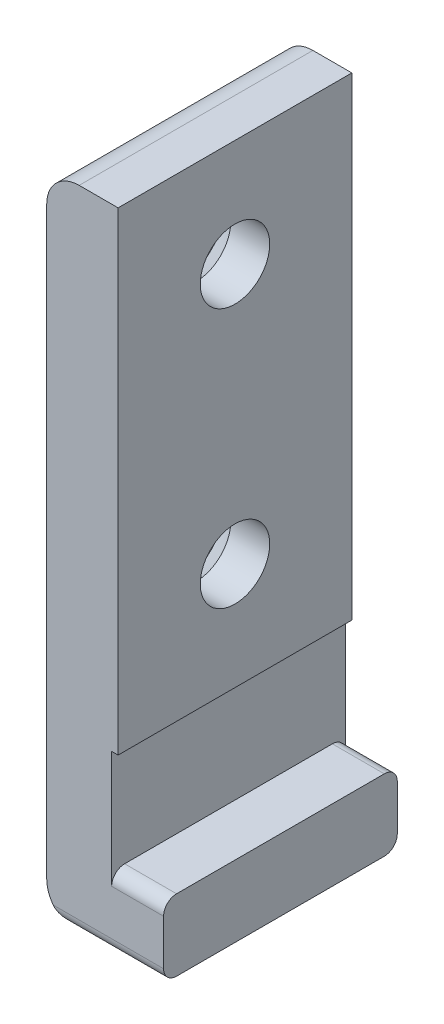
ISO-10303-21;
HEADER;
FILE_DESCRIPTION(('STEP AP214'),'2;1');
FILE_NAME('part.step','',(''),(''),'','','');
FILE_SCHEMA(('AUTOMOTIVE_DESIGN { 1 0 10303 214 1 1 1 1 }'));
ENDSEC;
DATA;
#1=APPLICATION_CONTEXT('core data for automotive mechanical design processes');
#2=APPLICATION_PROTOCOL_DEFINITION('international standard','automotive_design',2000,#1);
#3=PRODUCT_CONTEXT('',#1,'mechanical');
#4=PRODUCT('Part','Part','',(#3));
#5=PRODUCT_RELATED_PRODUCT_CATEGORY('part','',(#4));
#6=PRODUCT_DEFINITION_FORMATION('','',#4);
#7=PRODUCT_DEFINITION_CONTEXT('part definition',#1,'design');
#8=PRODUCT_DEFINITION('design','',#6,#7);
#9=PRODUCT_DEFINITION_SHAPE('','',#8);
#10=(LENGTH_UNIT() NAMED_UNIT(*) SI_UNIT(.MILLI.,.METRE.));
#11=(NAMED_UNIT(*) PLANE_ANGLE_UNIT() SI_UNIT($,.RADIAN.));
#12=(NAMED_UNIT(*) SI_UNIT($,.STERADIAN.) SOLID_ANGLE_UNIT());
#13=UNCERTAINTY_MEASURE_WITH_UNIT(LENGTH_MEASURE(1.E-05),#10,'distance_accuracy_value','');
#14=(GEOMETRIC_REPRESENTATION_CONTEXT(3) GLOBAL_UNCERTAINTY_ASSIGNED_CONTEXT((#13)) GLOBAL_UNIT_ASSIGNED_CONTEXT((#10,
#11,#12)) REPRESENTATION_CONTEXT('',''));
#15=CARTESIAN_POINT('',(0.,0.,0.));
#16=DIRECTION('',(0.,0.,1.));
#17=DIRECTION('',(1.,0.,0.));
#18=AXIS2_PLACEMENT_3D('',#15,#16,#17);
#19=CARTESIAN_POINT('',(0.,0.,9.));
#20=DIRECTION('',(0.,-1.,0.));
#21=DIRECTION('',(0.,0.,-1.));
#22=AXIS2_PLACEMENT_3D('',#19,#20,#21);
#23=PLANE('',#22);
#24=DIRECTION('',(0.,0.,-1.));
#25=VECTOR('',#24,1.);
#26=CARTESIAN_POINT('',(4.,0.,9.));
#27=LINE('',#26,#25);
#28=CARTESIAN_POINT('',(4.,0.,8.));
#29=VERTEX_POINT('',#28);
#30=CARTESIAN_POINT('',(4.,0.,-8.));
#31=VERTEX_POINT('',#30);
#32=EDGE_CURVE('E183',#29,#31,#27,.T.);
#33=ORIENTED_EDGE('',*,*,#32,.T.);
#34=DIRECTION('',(-1.,0.,0.));
#35=VECTOR('',#34,1.);
#36=CARTESIAN_POINT('',(0.,0.,-8.));
#37=LINE('',#36,#35);
#38=CARTESIAN_POINT('',(0.,0.,-8.));
#39=VERTEX_POINT('',#38);
#40=EDGE_CURVE('E330',#31,#39,#37,.T.);
#41=ORIENTED_EDGE('',*,*,#40,.T.);
#42=DIRECTION('',(0.,0.,-1.));
#43=VECTOR('',#42,1.);
#44=CARTESIAN_POINT('',(0.,0.,9.));
#45=LINE('',#44,#43);
#46=CARTESIAN_POINT('',(0.,0.,8.));
#47=VERTEX_POINT('',#46);
#48=EDGE_CURVE('E196',#47,#39,#45,.T.);
#49=ORIENTED_EDGE('',*,*,#48,.F.);
#50=DIRECTION('',(-1.,0.,0.));
#51=VECTOR('',#50,1.);
#52=CARTESIAN_POINT('',(0.,0.,8.));
#53=LINE('',#52,#51);
#54=EDGE_CURVE('E326',#47,#29,#53,.F.);
#55=ORIENTED_EDGE('',*,*,#54,.T.);
#56=EDGE_LOOP('',(#33,#41,#49,#55));
#57=FACE_BOUND('',#56,.T.);
#58=ADVANCED_FACE('F36',(#57),#23,.F.);
#59=CARTESIAN_POINT('',(0.,0.,9.));
#60=DIRECTION('',(-1.,0.,0.));
#61=DIRECTION('',(0.,0.,1.));
#62=AXIS2_PLACEMENT_3D('',#59,#60,#61);
#63=PLANE('',#62);
#64=DIRECTION('',(0.,1.,0.));
#65=VECTOR('',#64,1.);
#66=CARTESIAN_POINT('',(0.,0.,-9.));
#67=LINE('',#66,#65);
#68=CARTESIAN_POINT('',(0.,-1.,-9.));
#69=VERTEX_POINT('',#68);
#70=CARTESIAN_POINT('',(0.,8.,-9.));
#71=VERTEX_POINT('',#70);
#72=EDGE_CURVE('E169',#69,#71,#67,.T.);
#73=ORIENTED_EDGE('',*,*,#72,.T.);
#74=DIRECTION('',(0.,0.,1.));
#75=VECTOR('',#74,1.);
#76=CARTESIAN_POINT('',(0.,8.,-45.503424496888));
#77=LINE('',#76,#75);
#78=CARTESIAN_POINT('',(0.,8.,9.));
#79=VERTEX_POINT('',#78);
#80=EDGE_CURVE('E161',#71,#79,#77,.T.);
#81=ORIENTED_EDGE('',*,*,#80,.T.);
#82=DIRECTION('',(0.,1.,0.));
#83=VECTOR('',#82,1.);
#84=CARTESIAN_POINT('',(0.,0.,9.));
#85=LINE('',#84,#83);
#86=CARTESIAN_POINT('',(0.,-1.,9.));
#87=VERTEX_POINT('',#86);
#88=EDGE_CURVE('E170',#87,#79,#85,.T.);
#89=ORIENTED_EDGE('',*,*,#88,.F.);
#90=CARTESIAN_POINT('',(0.,-1.,8.));
#91=DIRECTION('',(-1.,0.,0.));
#92=DIRECTION('',(0.,0.,1.));
#93=AXIS2_PLACEMENT_3D('',#90,#91,#92);
#94=CIRCLE('',#93,1.);
#95=EDGE_CURVE('E11',#87,#47,#94,.T.);
#96=ORIENTED_EDGE('',*,*,#95,.T.);
#97=ORIENTED_EDGE('',*,*,#48,.T.);
#98=CARTESIAN_POINT('',(0.,-1.,-8.));
#99=DIRECTION('',(-1.,0.,0.));
#100=DIRECTION('',(0.,0.,1.));
#101=AXIS2_PLACEMENT_3D('',#98,#99,#100);
#102=CIRCLE('',#101,1.);
#103=EDGE_CURVE('E44',#39,#69,#102,.T.);
#104=ORIENTED_EDGE('',*,*,#103,.T.);
#105=EDGE_LOOP('',(#73,#81,#89,#96,#97,#104));
#106=FACE_BOUND('',#105,.T.);
#107=ADVANCED_FACE('F280',(#106),#63,.F.);
#108=CARTESIAN_POINT('',(-5.,44.5,9.));
#109=DIRECTION('',(0.,-1.,0.));
#110=DIRECTION('',(0.,0.,-1.));
#111=AXIS2_PLACEMENT_3D('',#108,#109,#110);
#112=PLANE('',#111);
#113=DIRECTION('',(-1.,0.,0.));
#114=VECTOR('',#113,1.);
#115=CARTESIAN_POINT('',(-5.,44.5,-9.));
#116=LINE('',#115,#114);
#117=CARTESIAN_POINT('',(0.5,44.5,-9.));
#118=VERTEX_POINT('',#117);
#119=CARTESIAN_POINT('',(-2.5,44.5,-9.));
#120=VERTEX_POINT('',#119);
#121=EDGE_CURVE('E145',#118,#120,#116,.T.);
#122=ORIENTED_EDGE('',*,*,#121,.T.);
#123=DIRECTION('',(0.,0.,-1.));
#124=VECTOR('',#123,1.);
#125=CARTESIAN_POINT('',(-2.5,44.5,9.));
#126=LINE('',#125,#124);
#127=CARTESIAN_POINT('',(-2.5,44.5,9.));
#128=VERTEX_POINT('',#127);
#129=EDGE_CURVE('E207',#120,#128,#126,.F.);
#130=ORIENTED_EDGE('',*,*,#129,.T.);
#131=DIRECTION('',(-1.,0.,0.));
#132=VECTOR('',#131,1.);
#133=CARTESIAN_POINT('',(-5.,44.5,9.));
#134=LINE('',#133,#132);
#135=CARTESIAN_POINT('',(0.5,44.5,9.));
#136=VERTEX_POINT('',#135);
#137=EDGE_CURVE('E173',#136,#128,#134,.T.);
#138=ORIENTED_EDGE('',*,*,#137,.F.);
#139=DIRECTION('',(0.,0.,1.));
#140=VECTOR('',#139,1.);
#141=CARTESIAN_POINT('',(0.5,44.5,-45.503424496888));
#142=LINE('',#141,#140);
#143=EDGE_CURVE('E149',#118,#136,#142,.T.);
#144=ORIENTED_EDGE('',*,*,#143,.F.);
#145=EDGE_LOOP('',(#122,#130,#138,#144));
#146=FACE_BOUND('',#145,.T.);
#147=ADVANCED_FACE('F286',(#146),#112,.F.);
#148=CARTESIAN_POINT('',(-5.,-5.5,9.));
#149=DIRECTION('',(1.,0.,0.));
#150=DIRECTION('',(0.,1.,0.));
#151=AXIS2_PLACEMENT_3D('',#148,#149,#150);
#152=PLANE('',#151);
#153=CARTESIAN_POINT('',(-5.,16.25,0.));
#154=DIRECTION('',(1.,0.,0.));
#155=DIRECTION('',(0.,1.,0.));
#156=AXIS2_PLACEMENT_3D('',#153,#154,#155);
#157=CIRCLE('',#156,5.17499999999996);
#158=CARTESIAN_POINT('',(-5.,21.425,0.));
#159=VERTEX_POINT('',#158);
#160=EDGE_CURVE('E220',#159,#159,#157,.T.);
#161=ORIENTED_EDGE('',*,*,#160,.T.);
#162=EDGE_LOOP('',(#161));
#163=FACE_BOUND('',#162,.T.);
#164=CARTESIAN_POINT('',(-5.,36.25,0.));
#165=DIRECTION('',(1.,0.,0.));
#166=DIRECTION('',(0.,1.,0.));
#167=AXIS2_PLACEMENT_3D('',#164,#165,#166);
#168=CIRCLE('',#167,5.17499999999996);
#169=CARTESIAN_POINT('',(-5.,41.425,0.));
#170=VERTEX_POINT('',#169);
#171=EDGE_CURVE('E217',#170,#170,#168,.T.);
#172=ORIENTED_EDGE('',*,*,#171,.T.);
#173=EDGE_LOOP('',(#172));
#174=FACE_BOUND('',#173,.T.);
#175=DIRECTION('',(0.,-1.,0.));
#176=VECTOR('',#175,1.);
#177=CARTESIAN_POINT('',(-5.,-5.5,9.));
#178=LINE('',#177,#176);
#179=CARTESIAN_POINT('',(-5.,42.,9.));
#180=VERTEX_POINT('',#179);
#181=CARTESIAN_POINT('',(-5.,-3.,9.));
#182=VERTEX_POINT('',#181);
#183=EDGE_CURVE('E177',#180,#182,#178,.T.);
#184=ORIENTED_EDGE('',*,*,#183,.F.);
#185=DIRECTION('',(0.,0.,-1.));
#186=VECTOR('',#185,1.);
#187=CARTESIAN_POINT('',(-5.,42.,9.));
#188=LINE('',#187,#186);
#189=CARTESIAN_POINT('',(-5.,42.,-9.));
#190=VERTEX_POINT('',#189);
#191=EDGE_CURVE('E200',#180,#190,#188,.T.);
#192=ORIENTED_EDGE('',*,*,#191,.T.);
#193=DIRECTION('',(0.,-1.,0.));
#194=VECTOR('',#193,1.);
#195=CARTESIAN_POINT('',(-5.,-5.5,-9.));
#196=LINE('',#195,#194);
#197=CARTESIAN_POINT('',(-5.,-3.,-9.));
#198=VERTEX_POINT('',#197);
#199=EDGE_CURVE('E186',#190,#198,#196,.T.);
#200=ORIENTED_EDGE('',*,*,#199,.T.);
#201=DIRECTION('',(0.,0.,-1.));
#202=VECTOR('',#201,1.);
#203=CARTESIAN_POINT('',(-5.,-3.,9.));
#204=LINE('',#203,#202);
#205=EDGE_CURVE('E198',#198,#182,#204,.F.);
#206=ORIENTED_EDGE('',*,*,#205,.T.);
#207=EDGE_LOOP('',(#184,#192,#200,#206));
#208=FACE_BOUND('',#207,.T.);
#209=ADVANCED_FACE('F306',(#163,#174,#208),#152,.F.);
#210=CARTESIAN_POINT('',(4.,-5.5,9.));
#211=DIRECTION('',(0.,1.,0.));
#212=DIRECTION('',(0.,0.,1.));
#213=AXIS2_PLACEMENT_3D('',#210,#211,#212);
#214=PLANE('',#213);
#215=DIRECTION('',(0.,0.,-1.));
#216=VECTOR('',#215,1.);
#217=CARTESIAN_POINT('',(4.,-5.5,9.));
#218=LINE('',#217,#216);
#219=CARTESIAN_POINT('',(4.,-5.5,8.));
#220=VERTEX_POINT('',#219);
#221=CARTESIAN_POINT('',(4.,-5.5,-8.));
#222=VERTEX_POINT('',#221);
#223=EDGE_CURVE('E193',#220,#222,#218,.T.);
#224=ORIENTED_EDGE('',*,*,#223,.F.);
#225=DIRECTION('',(1.,0.,0.));
#226=VECTOR('',#225,1.);
#227=CARTESIAN_POINT('',(4.,-5.5,8.));
#228=LINE('',#227,#226);
#229=CARTESIAN_POINT('',(-2.5,-5.5,8.));
#230=VERTEX_POINT('',#229);
#231=EDGE_CURVE('E246',#220,#230,#228,.F.);
#232=ORIENTED_EDGE('',*,*,#231,.T.);
#233=DIRECTION('',(0.,0.,-1.));
#234=VECTOR('',#233,1.);
#235=CARTESIAN_POINT('',(-2.5,-5.5,9.));
#236=LINE('',#235,#234);
#237=CARTESIAN_POINT('',(-2.5,-5.5,-8.));
#238=VERTEX_POINT('',#237);
#239=EDGE_CURVE('E214',#230,#238,#236,.T.);
#240=ORIENTED_EDGE('',*,*,#239,.T.);
#241=DIRECTION('',(1.,0.,0.));
#242=VECTOR('',#241,1.);
#243=CARTESIAN_POINT('',(4.,-5.5,-8.));
#244=LINE('',#243,#242);
#245=EDGE_CURVE('E243',#238,#222,#244,.T.);
#246=ORIENTED_EDGE('',*,*,#245,.T.);
#247=EDGE_LOOP('',(#224,#232,#240,#246));
#248=FACE_BOUND('',#247,.T.);
#249=ADVANCED_FACE('F321',(#248),#214,.F.);
#250=CARTESIAN_POINT('',(4.,0.,9.));
#251=DIRECTION('',(-1.,0.,0.));
#252=DIRECTION('',(0.,-1.,0.));
#253=AXIS2_PLACEMENT_3D('',#250,#251,#252);
#254=PLANE('',#253);
#255=DIRECTION('',(0.,1.,0.));
#256=VECTOR('',#255,1.);
#257=CARTESIAN_POINT('',(4.,0.,9.));
#258=LINE('',#257,#256);
#259=CARTESIAN_POINT('',(4.,-4.5,9.));
#260=VERTEX_POINT('',#259);
#261=CARTESIAN_POINT('',(4.,-1.,9.));
#262=VERTEX_POINT('',#261);
#263=EDGE_CURVE('E180',#260,#262,#258,.T.);
#264=ORIENTED_EDGE('',*,*,#263,.F.);
#265=CARTESIAN_POINT('',(4.,-4.5,8.));
#266=DIRECTION('',(-1.,0.,0.));
#267=DIRECTION('',(0.,-1.,0.));
#268=AXIS2_PLACEMENT_3D('',#265,#266,#267);
#269=CIRCLE('',#268,1.);
#270=EDGE_CURVE('E241',#260,#220,#269,.F.);
#271=ORIENTED_EDGE('',*,*,#270,.T.);
#272=ORIENTED_EDGE('',*,*,#223,.T.);
#273=CARTESIAN_POINT('',(4.,-4.5,-8.));
#274=DIRECTION('',(-1.,0.,0.));
#275=DIRECTION('',(0.,-1.,0.));
#276=AXIS2_PLACEMENT_3D('',#273,#274,#275);
#277=CIRCLE('',#276,1.);
#278=CARTESIAN_POINT('',(4.,-4.5,-9.));
#279=VERTEX_POINT('',#278);
#280=EDGE_CURVE('E239',#222,#279,#277,.F.);
#281=ORIENTED_EDGE('',*,*,#280,.T.);
#282=DIRECTION('',(0.,1.,0.));
#283=VECTOR('',#282,1.);
#284=CARTESIAN_POINT('',(4.,0.,-9.));
#285=LINE('',#284,#283);
#286=CARTESIAN_POINT('',(4.,-1.,-9.));
#287=VERTEX_POINT('',#286);
#288=EDGE_CURVE('E174',#279,#287,#285,.T.);
#289=ORIENTED_EDGE('',*,*,#288,.T.);
#290=CARTESIAN_POINT('',(4.,-1.,-8.));
#291=DIRECTION('',(-1.,0.,0.));
#292=DIRECTION('',(0.,-1.,0.));
#293=AXIS2_PLACEMENT_3D('',#290,#291,#292);
#294=CIRCLE('',#293,1.);
#295=EDGE_CURVE('E237',#287,#31,#294,.F.);
#296=ORIENTED_EDGE('',*,*,#295,.T.);
#297=ORIENTED_EDGE('',*,*,#32,.F.);
#298=CARTESIAN_POINT('',(4.,-1.,8.));
#299=DIRECTION('',(-1.,0.,0.));
#300=DIRECTION('',(0.,-1.,0.));
#301=AXIS2_PLACEMENT_3D('',#298,#299,#300);
#302=CIRCLE('',#301,1.);
#303=EDGE_CURVE('E235',#29,#262,#302,.F.);
#304=ORIENTED_EDGE('',*,*,#303,.T.);
#305=EDGE_LOOP('',(#264,#271,#272,#281,#289,#296,#297,#304));
#306=FACE_BOUND('',#305,.T.);
#307=ADVANCED_FACE('F319',(#306),#254,.F.);
#308=CARTESIAN_POINT('',(0.,0.,9.));
#309=DIRECTION('',(0.,0.,-1.));
#310=DIRECTION('',(-1.,0.,0.));
#311=AXIS2_PLACEMENT_3D('',#308,#309,#310);
#312=PLANE('',#311);
#313=CARTESIAN_POINT('',(-2.5,-3.,9.));
#314=DIRECTION('',(0.,0.,-1.));
#315=DIRECTION('',(-1.,0.,0.));
#316=AXIS2_PLACEMENT_3D('',#313,#314,#315);
#317=CIRCLE('',#316,2.5);
#318=CARTESIAN_POINT('',(-4.5,-4.5,9.));
#319=VERTEX_POINT('',#318);
#320=EDGE_CURVE('E209',#182,#319,#317,.F.);
#321=ORIENTED_EDGE('',*,*,#320,.T.);
#322=DIRECTION('',(1.,0.,0.));
#323=VECTOR('',#322,1.);
#324=CARTESIAN_POINT('',(0.,-4.5,9.));
#325=LINE('',#324,#323);
#326=EDGE_CURVE('E232',#319,#260,#325,.T.);
#327=ORIENTED_EDGE('',*,*,#326,.T.);
#328=ORIENTED_EDGE('',*,*,#263,.T.);
#329=DIRECTION('',(-1.,0.,0.));
#330=VECTOR('',#329,1.);
#331=CARTESIAN_POINT('',(0.,-1.,9.));
#332=LINE('',#331,#330);
#333=EDGE_CURVE('E229',#262,#87,#332,.T.);
#334=ORIENTED_EDGE('',*,*,#333,.T.);
#335=ORIENTED_EDGE('',*,*,#88,.T.);
#336=DIRECTION('',(1.,0.,0.));
#337=VECTOR('',#336,1.);
#338=CARTESIAN_POINT('',(0.,8.,9.));
#339=LINE('',#338,#337);
#340=CARTESIAN_POINT('',(0.500000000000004,8.,9.));
#341=VERTEX_POINT('',#340);
#342=EDGE_CURVE('E163',#79,#341,#339,.T.);
#343=ORIENTED_EDGE('',*,*,#342,.T.);
#344=DIRECTION('',(0.,1.,0.));
#345=VECTOR('',#344,1.);
#346=CARTESIAN_POINT('',(0.5,44.5,9.));
#347=LINE('',#346,#345);
#348=EDGE_CURVE('E155',#341,#136,#347,.T.);
#349=ORIENTED_EDGE('',*,*,#348,.T.);
#350=ORIENTED_EDGE('',*,*,#137,.T.);
#351=CARTESIAN_POINT('',(-2.5,42.,9.));
#352=DIRECTION('',(0.,0.,-1.));
#353=DIRECTION('',(-1.,0.,0.));
#354=AXIS2_PLACEMENT_3D('',#351,#352,#353);
#355=CIRCLE('',#354,2.5);
#356=EDGE_CURVE('E212',#128,#180,#355,.F.);
#357=ORIENTED_EDGE('',*,*,#356,.T.);
#358=ORIENTED_EDGE('',*,*,#183,.T.);
#359=EDGE_LOOP('',(#321,#327,#328,#334,#335,#343,#349,#350,#357,#358));
#360=FACE_BOUND('',#359,.T.);
#361=ADVANCED_FACE('F297',(#360),#312,.F.);
#362=CARTESIAN_POINT('',(0.,0.,-9.));
#363=DIRECTION('',(0.,0.,-1.));
#364=DIRECTION('',(-1.,0.,0.));
#365=AXIS2_PLACEMENT_3D('',#362,#363,#364);
#366=PLANE('',#365);
#367=ORIENTED_EDGE('',*,*,#288,.F.);
#368=DIRECTION('',(1.,0.,0.));
#369=VECTOR('',#368,1.);
#370=CARTESIAN_POINT('',(-2.5,-4.5,-9.));
#371=LINE('',#370,#369);
#372=CARTESIAN_POINT('',(-4.5,-4.5,-9.));
#373=VERTEX_POINT('',#372);
#374=EDGE_CURVE('E324',#279,#373,#371,.F.);
#375=ORIENTED_EDGE('',*,*,#374,.T.);
#376=CARTESIAN_POINT('',(-2.5,-3.,-9.));
#377=DIRECTION('',(0.,0.,-1.));
#378=DIRECTION('',(-1.,0.,0.));
#379=AXIS2_PLACEMENT_3D('',#376,#377,#378);
#380=CIRCLE('',#379,2.5);
#381=EDGE_CURVE('E203',#373,#198,#380,.T.);
#382=ORIENTED_EDGE('',*,*,#381,.T.);
#383=ORIENTED_EDGE('',*,*,#199,.F.);
#384=CARTESIAN_POINT('',(-2.5,42.,-9.));
#385=DIRECTION('',(0.,0.,-1.));
#386=DIRECTION('',(-1.,0.,0.));
#387=AXIS2_PLACEMENT_3D('',#384,#385,#386);
#388=CIRCLE('',#387,2.5);
#389=EDGE_CURVE('E205',#190,#120,#388,.T.);
#390=ORIENTED_EDGE('',*,*,#389,.T.);
#391=ORIENTED_EDGE('',*,*,#121,.F.);
#392=DIRECTION('',(0.,1.,0.));
#393=VECTOR('',#392,1.);
#394=CARTESIAN_POINT('',(0.5,44.5,-9.));
#395=LINE('',#394,#393);
#396=CARTESIAN_POINT('',(0.500000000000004,8.,-9.00000000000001));
#397=VERTEX_POINT('',#396);
#398=EDGE_CURVE('E137',#397,#118,#395,.T.);
#399=ORIENTED_EDGE('',*,*,#398,.F.);
#400=DIRECTION('',(1.,0.,0.));
#401=VECTOR('',#400,1.);
#402=CARTESIAN_POINT('',(0.,8.,-9.));
#403=LINE('',#402,#401);
#404=EDGE_CURVE('E142',#71,#397,#403,.T.);
#405=ORIENTED_EDGE('',*,*,#404,.F.);
#406=ORIENTED_EDGE('',*,*,#72,.F.);
#407=DIRECTION('',(-1.,0.,0.));
#408=VECTOR('',#407,1.);
#409=CARTESIAN_POINT('',(4.,-1.,-9.));
#410=LINE('',#409,#408);
#411=EDGE_CURVE('E325',#69,#287,#410,.F.);
#412=ORIENTED_EDGE('',*,*,#411,.T.);
#413=EDGE_LOOP('',(#367,#375,#382,#383,#390,#391,#399,#405,#406,#412));
#414=FACE_BOUND('',#413,.T.);
#415=ADVANCED_FACE('F140',(#414),#366,.T.);
#416=CARTESIAN_POINT('',(-2.5,42.,9.));
#417=DIRECTION('',(0.,0.,-1.));
#418=DIRECTION('',(-1.,0.,0.));
#419=AXIS2_PLACEMENT_3D('',#416,#417,#418);
#420=CYLINDRICAL_SURFACE('',#419,2.5);
#421=ORIENTED_EDGE('',*,*,#356,.F.);
#422=ORIENTED_EDGE('',*,*,#129,.F.);
#423=ORIENTED_EDGE('',*,*,#389,.F.);
#424=ORIENTED_EDGE('',*,*,#191,.F.);
#425=EDGE_LOOP('',(#421,#422,#423,#424));
#426=FACE_BOUND('',#425,.T.);
#427=ADVANCED_FACE('F289',(#426),#420,.T.);
#428=CARTESIAN_POINT('',(-2.5,-3.,9.));
#429=DIRECTION('',(0.,0.,-1.));
#430=DIRECTION('',(-1.,0.,0.));
#431=AXIS2_PLACEMENT_3D('',#428,#429,#430);
#432=CYLINDRICAL_SURFACE('',#431,2.5);
#433=ORIENTED_EDGE('',*,*,#239,.F.);
#434=CARTESIAN_POINT('',(-4.5,-4.5,9.));
#435=CARTESIAN_POINT('',(-4.47434871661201,-4.53421120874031,8.99999597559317));
#436=CARTESIAN_POINT('',(-4.4478362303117,-4.56772297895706,8.99824546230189));
#437=CARTESIAN_POINT('',(-4.39333893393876,-4.63311650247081,8.99164486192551));
#438=CARTESIAN_POINT('',(-4.36535674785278,-4.66500097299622,8.98680013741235));
#439=CARTESIAN_POINT('',(-4.28000865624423,-4.75742787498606,8.96832538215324));
#440=CARTESIAN_POINT('',(-4.22072597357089,-4.81542638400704,8.95073876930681));
#441=CARTESIAN_POINT('',(-4.0725131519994,-4.94699163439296,8.89840805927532));
#442=CARTESIAN_POINT('',(-3.98167805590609,-5.01671959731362,8.8595499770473));
#443=CARTESIAN_POINT('',(-3.79476697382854,-5.14156776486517,8.77090106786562));
#444=CARTESIAN_POINT('',(-3.69866218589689,-5.19659547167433,8.72104445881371));
#445=CARTESIAN_POINT('',(-3.53200593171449,-5.27834958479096,8.6298741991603));
#446=CARTESIAN_POINT('',(-3.46219486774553,-5.30864712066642,8.59032215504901));
#447=CARTESIAN_POINT('',(-3.32145844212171,-5.36238926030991,8.5086034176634));
#448=CARTESIAN_POINT('',(-3.25053260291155,-5.38583083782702,8.46643557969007));
#449=CARTESIAN_POINT('',(-3.03694020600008,-5.44613120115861,8.33740514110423));
#450=CARTESIAN_POINT('',(-2.89304316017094,-5.47316437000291,8.24778070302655));
#451=CARTESIAN_POINT('',(-2.66875555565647,-5.49559347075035,8.1067181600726));
#452=CARTESIAN_POINT('',(-2.58860130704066,-5.49971490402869,8.05603597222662));
#453=CARTESIAN_POINT('',(-2.50563435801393,-5.49999523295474,8.0035634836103));
#454=CARTESIAN_POINT('',(-2.50281717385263,-5.49999999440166,8.00178173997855));
#455=CARTESIAN_POINT('',(-2.5,-5.5,8.));
#456=B_SPLINE_CURVE_WITH_KNOTS('',3,(#434,#435,#436,#437,#438,#439,#440,#441,#442,#443,#444,
#445,#446,#447,#448,#449,#450,#451,#452,#453,#454,#455),.UNSPECIFIED.,.F.,.F.,(4,2,2,2,2,2,2,2,
2,2,4),(0.,0.128161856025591,0.256102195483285,0.509450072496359,0.870315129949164,
1.23340004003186,1.49037285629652,1.74745893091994,2.26009785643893,2.54460067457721,
2.55460068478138),.UNSPECIFIED.);
#457=EDGE_CURVE('E255',#230,#319,#456,.F.);
#458=ORIENTED_EDGE('',*,*,#457,.T.);
#459=ORIENTED_EDGE('',*,*,#320,.F.);
#460=ORIENTED_EDGE('',*,*,#205,.F.);
#461=ORIENTED_EDGE('',*,*,#381,.F.);
#462=CARTESIAN_POINT('',(-4.5,-4.5,-9.));
#463=CARTESIAN_POINT('',(-4.47434871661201,-4.53421120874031,-8.99999597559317));
#464=CARTESIAN_POINT('',(-4.4478362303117,-4.56772297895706,-8.99824546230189));
#465=CARTESIAN_POINT('',(-4.39333893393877,-4.63311650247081,-8.99164486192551));
#466=CARTESIAN_POINT('',(-4.36535674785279,-4.66500097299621,-8.98680013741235));
#467=CARTESIAN_POINT('',(-4.28000865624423,-4.75742787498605,-8.96832538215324));
#468=CARTESIAN_POINT('',(-4.22072597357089,-4.81542638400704,-8.95073876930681));
#469=CARTESIAN_POINT('',(-4.0725131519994,-4.94699163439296,-8.89840805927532));
#470=CARTESIAN_POINT('',(-3.98167805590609,-5.01671959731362,-8.8595499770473));
#471=CARTESIAN_POINT('',(-3.79476697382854,-5.14156776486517,-8.77090106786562));
#472=CARTESIAN_POINT('',(-3.69866218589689,-5.19659547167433,-8.72104445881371));
#473=CARTESIAN_POINT('',(-3.5320059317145,-5.27834958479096,-8.6298741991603));
#474=CARTESIAN_POINT('',(-3.46219486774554,-5.30864712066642,-8.590322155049));
#475=CARTESIAN_POINT('',(-3.32145844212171,-5.36238926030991,-8.50860341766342));
#476=CARTESIAN_POINT('',(-3.25053260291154,-5.38583083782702,-8.46643557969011));
#477=CARTESIAN_POINT('',(-3.03694020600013,-5.44613120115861,-8.33740514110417));
#478=CARTESIAN_POINT('',(-2.89304316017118,-5.47316437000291,-8.24778070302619));
#479=CARTESIAN_POINT('',(-2.66875555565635,-5.49559347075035,-8.10671816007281));
#480=CARTESIAN_POINT('',(-2.58860130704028,-5.49971490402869,-8.05603597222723));
#481=CARTESIAN_POINT('',(-2.50563435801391,-5.49999523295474,-8.00356348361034));
#482=CARTESIAN_POINT('',(-2.50281717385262,-5.49999999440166,-8.00178173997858));
#483=CARTESIAN_POINT('',(-2.5,-5.5,-8.));
#484=B_SPLINE_CURVE_WITH_KNOTS('',3,(#462,#463,#464,#465,#466,#467,#468,#469,#470,#471,#472,
#473,#474,#475,#476,#477,#478,#479,#480,#481,#482,#483),.UNSPECIFIED.,.F.,.F.,(4,2,2,2,2,2,2,2,
2,2,4),(0.,0.128161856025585,0.256102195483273,0.509450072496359,0.870315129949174,
1.23340004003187,1.49037285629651,1.74745893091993,2.26009785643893,2.54460067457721,
2.55460068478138),.UNSPECIFIED.);
#485=EDGE_CURVE('E248',#373,#238,#484,.T.);
#486=ORIENTED_EDGE('',*,*,#485,.T.);
#487=EDGE_LOOP('',(#433,#458,#459,#460,#461,#486));
#488=FACE_BOUND('',#487,.T.);
#489=ADVANCED_FACE('F261',(#488),#432,.T.);
#490=CARTESIAN_POINT('',(0.,8.,-45.503424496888));
#491=DIRECTION('',(0.,-1.,0.));
#492=DIRECTION('',(0.,0.,-1.));
#493=AXIS2_PLACEMENT_3D('',#490,#491,#492);
#494=PLANE('',#493);
#495=ORIENTED_EDGE('',*,*,#80,.F.);
#496=ORIENTED_EDGE('',*,*,#404,.T.);
#497=DIRECTION('',(0.,0.,1.));
#498=VECTOR('',#497,1.);
#499=CARTESIAN_POINT('',(0.500000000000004,8.,-45.503424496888));
#500=LINE('',#499,#498);
#501=EDGE_CURVE('E150',#397,#341,#500,.T.);
#502=ORIENTED_EDGE('',*,*,#501,.T.);
#503=ORIENTED_EDGE('',*,*,#342,.F.);
#504=EDGE_LOOP('',(#495,#496,#502,#503));
#505=FACE_BOUND('',#504,.T.);
#506=ADVANCED_FACE('F160',(#505),#494,.T.);
#507=CARTESIAN_POINT('',(0.5,44.5,-45.503424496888));
#508=DIRECTION('',(1.,0.,0.));
#509=DIRECTION('',(0.,1.,0.));
#510=AXIS2_PLACEMENT_3D('',#507,#508,#509);
#511=PLANE('',#510);
#512=CARTESIAN_POINT('',(0.500000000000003,16.25,0.));
#513=DIRECTION('',(1.,0.,0.));
#514=DIRECTION('',(0.,-1.,0.));
#515=AXIS2_PLACEMENT_3D('',#512,#513,#514);
#516=CIRCLE('',#515,2.675);
#517=CARTESIAN_POINT('',(0.500000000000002,18.925,0.));
#518=VERTEX_POINT('',#517);
#519=EDGE_CURVE('E337',#518,#518,#516,.T.);
#520=ORIENTED_EDGE('',*,*,#519,.F.);
#521=EDGE_LOOP('',(#520));
#522=FACE_BOUND('',#521,.T.);
#523=CARTESIAN_POINT('',(0.500000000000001,36.25,0.));
#524=DIRECTION('',(1.,0.,0.));
#525=DIRECTION('',(0.,1.,0.));
#526=AXIS2_PLACEMENT_3D('',#523,#524,#525);
#527=CIRCLE('',#526,2.675);
#528=CARTESIAN_POINT('',(0.5,38.925,0.));
#529=VERTEX_POINT('',#528);
#530=EDGE_CURVE('E335',#529,#529,#527,.T.);
#531=ORIENTED_EDGE('',*,*,#530,.F.);
#532=EDGE_LOOP('',(#531));
#533=FACE_BOUND('',#532,.T.);
#534=ORIENTED_EDGE('',*,*,#501,.F.);
#535=ORIENTED_EDGE('',*,*,#398,.T.);
#536=ORIENTED_EDGE('',*,*,#143,.T.);
#537=ORIENTED_EDGE('',*,*,#348,.F.);
#538=EDGE_LOOP('',(#534,#535,#536,#537));
#539=FACE_BOUND('',#538,.T.);
#540=ADVANCED_FACE('F153',(#522,#533,#539),#511,.T.);
#541=CARTESIAN_POINT('',(-5.00000000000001,36.25,0.));
#542=DIRECTION('',(1.,0.,0.));
#543=DIRECTION('',(0.,1.,0.));
#544=AXIS2_PLACEMENT_3D('',#541,#542,#543);
#545=CYLINDRICAL_SURFACE('',#544,2.675);
#546=CARTESIAN_POINT('',(-2.50000000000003,36.25,0.));
#547=DIRECTION('',(1.,0.,0.));
#548=DIRECTION('',(0.,0.,-1.));
#549=AXIS2_PLACEMENT_3D('',#546,#547,#548);
#550=CIRCLE('',#549,2.675);
#551=CARTESIAN_POINT('',(-2.50000000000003,38.925,0.));
#552=VERTEX_POINT('',#551);
#553=EDGE_CURVE('E226',#552,#552,#550,.F.);
#554=CARTESIAN_POINT('',(-2.50000000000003,38.925,0.));
#555=CARTESIAN_POINT('',(-2.46875000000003,38.925,0.));
#556=CARTESIAN_POINT('',(-2.43750000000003,38.925,0.));
#557=CARTESIAN_POINT('',(-2.37500000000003,38.925,0.));
#558=CARTESIAN_POINT('',(-2.34375000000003,38.925,0.));
#559=CARTESIAN_POINT('',(-2.28125000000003,38.925,0.));
#560=CARTESIAN_POINT('',(-2.25000000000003,38.925,0.));
#561=CARTESIAN_POINT('',(-2.18750000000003,38.925,0.));
#562=CARTESIAN_POINT('',(-2.15625000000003,38.925,0.));
#563=CARTESIAN_POINT('',(-2.09375000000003,38.925,0.));
#564=CARTESIAN_POINT('',(-2.06250000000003,38.925,0.));
#565=CARTESIAN_POINT('',(-2.00000000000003,38.925,0.));
#566=CARTESIAN_POINT('',(-1.96875000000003,38.925,0.));
#567=CARTESIAN_POINT('',(-1.90625000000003,38.925,0.));
#568=CARTESIAN_POINT('',(-1.87500000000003,38.925,0.));
#569=CARTESIAN_POINT('',(-1.81250000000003,38.925,0.));
#570=CARTESIAN_POINT('',(-1.78125000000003,38.925,0.));
#571=CARTESIAN_POINT('',(-1.71875000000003,38.925,0.));
#572=CARTESIAN_POINT('',(-1.68750000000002,38.925,0.));
#573=CARTESIAN_POINT('',(-1.62500000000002,38.925,0.));
#574=CARTESIAN_POINT('',(-1.59375000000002,38.925,0.));
#575=CARTESIAN_POINT('',(-1.53125000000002,38.925,0.));
#576=CARTESIAN_POINT('',(-1.50000000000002,38.925,0.));
#577=CARTESIAN_POINT('',(-1.43750000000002,38.925,0.));
#578=CARTESIAN_POINT('',(-1.40625000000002,38.925,0.));
#579=CARTESIAN_POINT('',(-1.34375000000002,38.925,0.));
#580=CARTESIAN_POINT('',(-1.31250000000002,38.925,0.));
#581=CARTESIAN_POINT('',(-1.25000000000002,38.925,0.));
#582=CARTESIAN_POINT('',(-1.21875000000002,38.925,0.));
#583=CARTESIAN_POINT('',(-1.15625000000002,38.925,0.));
#584=CARTESIAN_POINT('',(-1.12500000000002,38.925,0.));
#585=CARTESIAN_POINT('',(-1.06250000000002,38.925,0.));
#586=CARTESIAN_POINT('',(-1.03125000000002,38.925,0.));
#587=CARTESIAN_POINT('',(-0.968750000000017,38.925,0.));
#588=CARTESIAN_POINT('',(-0.937500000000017,38.925,0.));
#589=CARTESIAN_POINT('',(-0.875000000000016,38.925,0.));
#590=CARTESIAN_POINT('',(-0.843750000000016,38.925,0.));
#591=CARTESIAN_POINT('',(-0.781250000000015,38.925,0.));
#592=CARTESIAN_POINT('',(-0.750000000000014,38.925,0.));
#593=CARTESIAN_POINT('',(-0.687500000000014,38.925,0.));
#594=CARTESIAN_POINT('',(-0.656250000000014,38.925,0.));
#595=CARTESIAN_POINT('',(-0.593750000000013,38.925,0.));
#596=CARTESIAN_POINT('',(-0.562500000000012,38.925,0.));
#597=CARTESIAN_POINT('',(-0.500000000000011,38.925,0.));
#598=CARTESIAN_POINT('',(-0.468750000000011,38.925,0.));
#599=CARTESIAN_POINT('',(-0.40625000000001,38.925,0.));
#600=CARTESIAN_POINT('',(-0.37500000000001,38.925,0.));
#601=CARTESIAN_POINT('',(-0.31250000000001,38.925,0.));
#602=CARTESIAN_POINT('',(-0.281250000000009,38.925,0.));
#603=CARTESIAN_POINT('',(-0.218750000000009,38.925,0.));
#604=CARTESIAN_POINT('',(-0.187500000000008,38.925,0.));
#605=CARTESIAN_POINT('',(-0.125000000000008,38.925,0.));
#606=CARTESIAN_POINT('',(-0.0937500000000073,38.925,0.));
#607=CARTESIAN_POINT('',(-0.0312500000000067,38.925,0.));
#608=CARTESIAN_POINT('',(0.,38.925,0.));
#609=CARTESIAN_POINT('',(0.0624999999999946,38.925,0.));
#610=CARTESIAN_POINT('',(0.0937499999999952,38.925,0.));
#611=CARTESIAN_POINT('',(0.156249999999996,38.925,0.));
#612=CARTESIAN_POINT('',(0.187499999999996,38.925,0.));
#613=CARTESIAN_POINT('',(0.249999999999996,38.925,0.));
#614=CARTESIAN_POINT('',(0.281249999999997,38.925,0.));
#615=CARTESIAN_POINT('',(0.343749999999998,38.925,0.));
#616=CARTESIAN_POINT('',(0.374999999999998,38.925,0.));
#617=CARTESIAN_POINT('',(0.437499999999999,38.925,0.));
#618=CARTESIAN_POINT('',(0.468749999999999,38.925,0.));
#619=CARTESIAN_POINT('',(0.5,38.925,0.));
#620=B_SPLINE_CURVE_WITH_KNOTS('',3,(#554,#555,#556,#557,#558,#559,#560,#561,#562,#563,#564,
#565,#566,#567,#568,#569,#570,#571,#572,#573,#574,#575,#576,#577,#578,#579,#580,#581,#582,#583,
#584,#585,#586,#587,#588,#589,#590,#591,#592,#593,#594,#595,#596,#597,#598,#599,#600,#601,#602,
#603,#604,#605,#606,#607,#608,#609,#610,#611,#612,#613,#614,#615,#616,#617,#618,#619),
.UNSPECIFIED.,.F.,.F.,(4,2,2,2,2,2,2,2,2,2,2,2,2,2,2,2,2,2,2,2,2,2,2,2,2,2,2,2,2,2,2,2,4),(0.,
0.0937500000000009,0.187500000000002,0.281250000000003,0.375000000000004,0.468750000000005,
0.562500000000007,0.656250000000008,0.750000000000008,0.843750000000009,0.93750000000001,
1.03125000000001,1.12500000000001,1.21875000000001,1.31250000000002,1.40625000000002,
1.50000000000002,1.59375000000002,1.68750000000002,1.78125000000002,1.87500000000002,
1.96875000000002,2.06250000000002,2.15625000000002,2.25000000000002,2.34375000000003,
2.43750000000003,2.53125000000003,2.62500000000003,2.71875000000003,2.81250000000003,
2.90625000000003,3.00000000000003),.UNSPECIFIED.);
#621=EDGE_CURVE('BSEAM349',#552,#529,#620,.T.);
#622=ORIENTED_EDGE('',*,*,#553,.T.);
#623=ORIENTED_EDGE('',*,*,#530,.T.);
#624=ORIENTED_EDGE('',*,*,#621,.T.);
#625=ORIENTED_EDGE('',*,*,#621,.F.);
#626=EDGE_LOOP('',(#622,#624,#623,#625));
#627=FACE_BOUND('',#626,.T.);
#628=ADVANCED_FACE('F349',(#627),#545,.F.);
#629=CARTESIAN_POINT('',(-5.,16.25,0.));
#630=DIRECTION('',(1.,0.,0.));
#631=DIRECTION('',(0.,1.,0.));
#632=AXIS2_PLACEMENT_3D('',#629,#630,#631);
#633=CYLINDRICAL_SURFACE('',#632,2.675);
#634=CARTESIAN_POINT('',(-2.50000000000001,16.25,0.));
#635=DIRECTION('',(1.,0.,0.));
#636=DIRECTION('',(0.,0.,-1.));
#637=AXIS2_PLACEMENT_3D('',#634,#635,#636);
#638=CIRCLE('',#637,2.675);
#639=CARTESIAN_POINT('',(-2.50000000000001,18.925,0.));
#640=VERTEX_POINT('',#639);
#641=EDGE_CURVE('E223',#640,#640,#638,.F.);
#642=CARTESIAN_POINT('',(-2.50000000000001,18.925,0.));
#643=CARTESIAN_POINT('',(-2.46875000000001,18.925,0.));
#644=CARTESIAN_POINT('',(-2.43750000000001,18.925,0.));
#645=CARTESIAN_POINT('',(-2.37500000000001,18.925,0.));
#646=CARTESIAN_POINT('',(-2.34375000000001,18.925,0.));
#647=CARTESIAN_POINT('',(-2.28125000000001,18.925,0.));
#648=CARTESIAN_POINT('',(-2.25000000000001,18.925,0.));
#649=CARTESIAN_POINT('',(-2.18750000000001,18.925,0.));
#650=CARTESIAN_POINT('',(-2.15625000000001,18.925,0.));
#651=CARTESIAN_POINT('',(-2.09375000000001,18.925,0.));
#652=CARTESIAN_POINT('',(-2.06250000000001,18.925,0.));
#653=CARTESIAN_POINT('',(-2.00000000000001,18.925,0.));
#654=CARTESIAN_POINT('',(-1.96875000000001,18.925,0.));
#655=CARTESIAN_POINT('',(-1.90625000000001,18.925,0.));
#656=CARTESIAN_POINT('',(-1.87500000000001,18.925,0.));
#657=CARTESIAN_POINT('',(-1.81250000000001,18.925,0.));
#658=CARTESIAN_POINT('',(-1.78125000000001,18.925,0.));
#659=CARTESIAN_POINT('',(-1.71875000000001,18.925,0.));
#660=CARTESIAN_POINT('',(-1.68750000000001,18.925,0.));
#661=CARTESIAN_POINT('',(-1.62500000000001,18.925,0.));
#662=CARTESIAN_POINT('',(-1.59375000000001,18.925,0.));
#663=CARTESIAN_POINT('',(-1.53125000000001,18.925,0.));
#664=CARTESIAN_POINT('',(-1.50000000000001,18.925,0.));
#665=CARTESIAN_POINT('',(-1.43750000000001,18.925,0.));
#666=CARTESIAN_POINT('',(-1.40625000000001,18.925,0.));
#667=CARTESIAN_POINT('',(-1.34375000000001,18.925,0.));
#668=CARTESIAN_POINT('',(-1.31250000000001,18.925,0.));
#669=CARTESIAN_POINT('',(-1.25000000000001,18.925,0.));
#670=CARTESIAN_POINT('',(-1.21875000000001,18.925,0.));
#671=CARTESIAN_POINT('',(-1.15625000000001,18.925,0.));
#672=CARTESIAN_POINT('',(-1.12500000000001,18.925,0.));
#673=CARTESIAN_POINT('',(-1.06250000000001,18.925,0.));
#674=CARTESIAN_POINT('',(-1.03125000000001,18.925,0.));
#675=CARTESIAN_POINT('',(-0.968750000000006,18.925,0.));
#676=CARTESIAN_POINT('',(-0.937500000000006,18.925,0.));
#677=CARTESIAN_POINT('',(-0.875000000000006,18.925,0.));
#678=CARTESIAN_POINT('',(-0.843750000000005,18.925,0.));
#679=CARTESIAN_POINT('',(-0.781250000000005,18.925,0.));
#680=CARTESIAN_POINT('',(-0.750000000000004,18.925,0.));
#681=CARTESIAN_POINT('',(-0.687500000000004,18.925,0.));
#682=CARTESIAN_POINT('',(-0.656250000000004,18.925,0.));
#683=CARTESIAN_POINT('',(-0.593750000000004,18.925,0.));
#684=CARTESIAN_POINT('',(-0.562500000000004,18.925,0.));
#685=CARTESIAN_POINT('',(-0.500000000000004,18.925,0.));
#686=CARTESIAN_POINT('',(-0.468750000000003,18.925,0.));
#687=CARTESIAN_POINT('',(-0.406250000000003,18.925,0.));
#688=CARTESIAN_POINT('',(-0.375000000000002,18.925,0.));
#689=CARTESIAN_POINT('',(-0.312500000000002,18.925,0.));
#690=CARTESIAN_POINT('',(-0.281250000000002,18.925,0.));
#691=CARTESIAN_POINT('',(-0.218750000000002,18.925,0.));
#692=CARTESIAN_POINT('',(-0.187500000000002,18.925,0.));
#693=CARTESIAN_POINT('',(-0.125000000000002,18.925,0.));
#694=CARTESIAN_POINT('',(-0.0937500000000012,18.925,0.));
#695=CARTESIAN_POINT('',(-0.0312500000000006,18.925,0.));
#696=CARTESIAN_POINT('',(0.,18.925,0.));
#697=CARTESIAN_POINT('',(0.0625000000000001,18.925,0.));
#698=CARTESIAN_POINT('',(0.0937500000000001,18.925,0.));
#699=CARTESIAN_POINT('',(0.15625,18.925,0.));
#700=CARTESIAN_POINT('',(0.1875,18.925,0.));
#701=CARTESIAN_POINT('',(0.25,18.925,0.));
#702=CARTESIAN_POINT('',(0.281250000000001,18.925,0.));
#703=CARTESIAN_POINT('',(0.343750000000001,18.925,0.));
#704=CARTESIAN_POINT('',(0.375000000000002,18.925,0.));
#705=CARTESIAN_POINT('',(0.437500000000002,18.925,0.));
#706=CARTESIAN_POINT('',(0.468750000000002,18.925,0.));
#707=CARTESIAN_POINT('',(0.500000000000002,18.925,0.));
#708=B_SPLINE_CURVE_WITH_KNOTS('',3,(#642,#643,#644,#645,#646,#647,#648,#649,#650,#651,#652,
#653,#654,#655,#656,#657,#658,#659,#660,#661,#662,#663,#664,#665,#666,#667,#668,#669,#670,#671,
#672,#673,#674,#675,#676,#677,#678,#679,#680,#681,#682,#683,#684,#685,#686,#687,#688,#689,#690,
#691,#692,#693,#694,#695,#696,#697,#698,#699,#700,#701,#702,#703,#704,#705,#706,#707),
.UNSPECIFIED.,.F.,.F.,(4,2,2,2,2,2,2,2,2,2,2,2,2,2,2,2,2,2,2,2,2,2,2,2,2,2,2,2,2,2,2,2,4),(0.,
0.0937500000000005,0.187500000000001,0.281250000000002,0.375000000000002,0.468750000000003,
0.562500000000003,0.656250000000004,0.750000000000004,0.843750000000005,0.937500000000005,
1.03125000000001,1.12500000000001,1.21875000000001,1.31250000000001,1.40625000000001,
1.50000000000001,1.59375000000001,1.68750000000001,1.78125000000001,1.87500000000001,
1.96875000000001,2.06250000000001,2.15625000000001,2.25000000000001,2.34375000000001,
2.43750000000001,2.53125000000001,2.62500000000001,2.71875000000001,2.81250000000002,
2.90625000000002,3.00000000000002),.UNSPECIFIED.);
#709=EDGE_CURVE('BSEAM345',#640,#518,#708,.T.);
#710=ORIENTED_EDGE('',*,*,#641,.T.);
#711=ORIENTED_EDGE('',*,*,#519,.T.);
#712=ORIENTED_EDGE('',*,*,#709,.T.);
#713=ORIENTED_EDGE('',*,*,#709,.F.);
#714=EDGE_LOOP('',(#710,#712,#711,#713));
#715=FACE_BOUND('',#714,.T.);
#716=ADVANCED_FACE('F345',(#715),#633,.F.);
#717=CARTESIAN_POINT('',(-5.,16.25,0.));
#718=DIRECTION('',(-1.,0.,0.));
#719=DIRECTION('',(0.,0.,1.));
#720=AXIS2_PLACEMENT_3D('',#717,#718,#719);
#721=CONICAL_SURFACE('',#720,5.17499999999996,0.785398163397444);
#722=ORIENTED_EDGE('',*,*,#641,.F.);
#723=EDGE_LOOP('',(#722));
#724=FACE_BOUND('',#723,.T.);
#725=ORIENTED_EDGE('',*,*,#160,.F.);
#726=EDGE_LOOP('',(#725));
#727=FACE_BOUND('',#726,.T.);
#728=ADVANCED_FACE('F438',(#724,#727),#721,.F.);
#729=CARTESIAN_POINT('',(-5.,36.25,0.));
#730=DIRECTION('',(-1.,0.,0.));
#731=DIRECTION('',(0.,0.,1.));
#732=AXIS2_PLACEMENT_3D('',#729,#730,#731);
#733=CONICAL_SURFACE('',#732,5.17499999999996,0.785398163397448);
#734=ORIENTED_EDGE('',*,*,#553,.F.);
#735=EDGE_LOOP('',(#734));
#736=FACE_BOUND('',#735,.T.);
#737=ORIENTED_EDGE('',*,*,#171,.F.);
#738=EDGE_LOOP('',(#737));
#739=FACE_BOUND('',#738,.T.);
#740=ADVANCED_FACE('F414',(#736,#739),#733,.F.);
#741=CARTESIAN_POINT('',(0.,-4.5,8.));
#742=DIRECTION('',(1.,0.,0.));
#743=DIRECTION('',(0.,0.,-1.));
#744=AXIS2_PLACEMENT_3D('',#741,#742,#743);
#745=CYLINDRICAL_SURFACE('',#744,1.);
#746=ORIENTED_EDGE('',*,*,#457,.F.);
#747=ORIENTED_EDGE('',*,*,#231,.F.);
#748=ORIENTED_EDGE('',*,*,#270,.F.);
#749=ORIENTED_EDGE('',*,*,#326,.F.);
#750=EDGE_LOOP('',(#746,#747,#748,#749));
#751=FACE_BOUND('',#750,.T.);
#752=ADVANCED_FACE('F269',(#751),#745,.T.);
#753=CARTESIAN_POINT('',(4.,-4.5,-8.));
#754=DIRECTION('',(-1.,0.,0.));
#755=DIRECTION('',(0.,0.,1.));
#756=AXIS2_PLACEMENT_3D('',#753,#754,#755);
#757=CYLINDRICAL_SURFACE('',#756,1.);
#758=ORIENTED_EDGE('',*,*,#485,.F.);
#759=ORIENTED_EDGE('',*,*,#374,.F.);
#760=ORIENTED_EDGE('',*,*,#280,.F.);
#761=ORIENTED_EDGE('',*,*,#245,.F.);
#762=EDGE_LOOP('',(#758,#759,#760,#761));
#763=FACE_BOUND('',#762,.T.);
#764=ADVANCED_FACE('F265',(#763),#757,.T.);
#765=CARTESIAN_POINT('',(0.,-1.,-8.));
#766=DIRECTION('',(1.,0.,0.));
#767=DIRECTION('',(0.,0.,-1.));
#768=AXIS2_PLACEMENT_3D('',#765,#766,#767);
#769=CYLINDRICAL_SURFACE('',#768,1.);
#770=ORIENTED_EDGE('',*,*,#295,.F.);
#771=ORIENTED_EDGE('',*,*,#411,.F.);
#772=ORIENTED_EDGE('',*,*,#103,.F.);
#773=ORIENTED_EDGE('',*,*,#40,.F.);
#774=EDGE_LOOP('',(#770,#771,#772,#773));
#775=FACE_BOUND('',#774,.T.);
#776=ADVANCED_FACE('F268',(#775),#769,.T.);
#777=CARTESIAN_POINT('',(0.,-1.,8.));
#778=DIRECTION('',(-1.,0.,0.));
#779=DIRECTION('',(0.,0.,1.));
#780=AXIS2_PLACEMENT_3D('',#777,#778,#779);
#781=CYLINDRICAL_SURFACE('',#780,1.);
#782=ORIENTED_EDGE('',*,*,#303,.F.);
#783=ORIENTED_EDGE('',*,*,#54,.F.);
#784=ORIENTED_EDGE('',*,*,#95,.F.);
#785=ORIENTED_EDGE('',*,*,#333,.F.);
#786=EDGE_LOOP('',(#782,#783,#784,#785));
#787=FACE_BOUND('',#786,.T.);
#788=ADVANCED_FACE('F38',(#787),#781,.T.);
#789=CLOSED_SHELL('',(#58,#107,#147,#209,#249,#307,#361,#415,#427,#489,#506,#540,#628,#716,#728,
#740,#752,#764,#776,#788));
#790=MANIFOLD_SOLID_BREP('B2',#789);
#791=ADVANCED_BREP_SHAPE_REPRESENTATION('',(#18,#790),#14);
#792=SHAPE_DEFINITION_REPRESENTATION(#9,#791);
ENDSEC;
END-ISO-10303-21;
